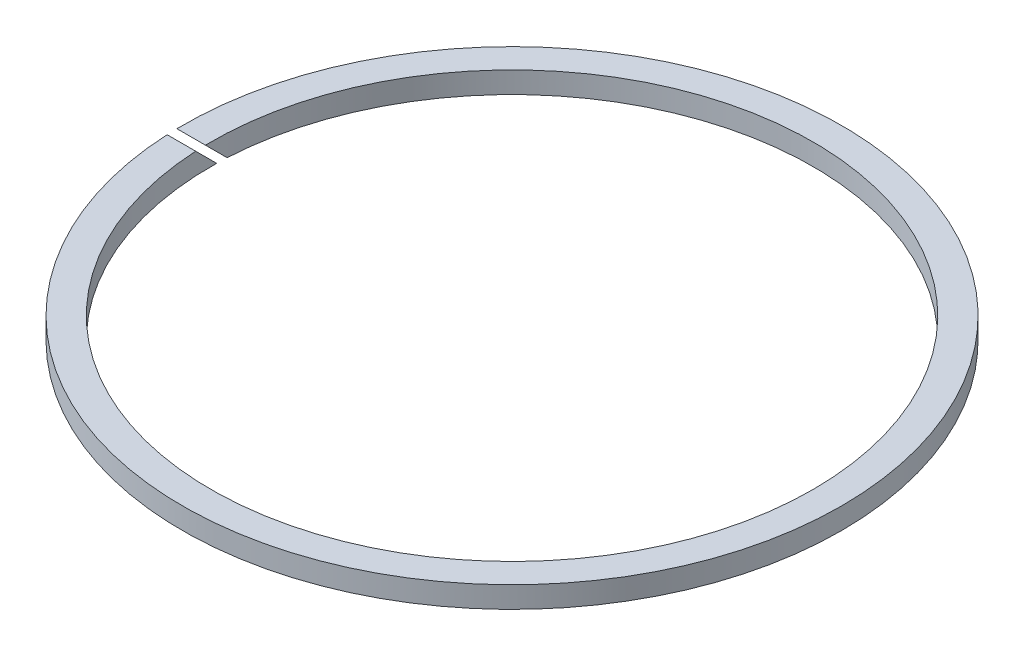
ISO-10303-21;
HEADER;
FILE_DESCRIPTION(('STEP AP214'),'2;1');
FILE_NAME('part.step','',(''),(''),'','','');
FILE_SCHEMA(('AUTOMOTIVE_DESIGN { 1 0 10303 214 1 1 1 1 }'));
ENDSEC;
DATA;
#1=APPLICATION_CONTEXT('core data for automotive mechanical design processes');
#2=APPLICATION_PROTOCOL_DEFINITION('international standard','automotive_design',2000,#1);
#3=PRODUCT_CONTEXT('',#1,'mechanical');
#4=PRODUCT('Part','Part','',(#3));
#5=PRODUCT_RELATED_PRODUCT_CATEGORY('part','',(#4));
#6=PRODUCT_DEFINITION_FORMATION('','',#4);
#7=PRODUCT_DEFINITION_CONTEXT('part definition',#1,'design');
#8=PRODUCT_DEFINITION('design','',#6,#7);
#9=PRODUCT_DEFINITION_SHAPE('','',#8);
#10=(LENGTH_UNIT() NAMED_UNIT(*) SI_UNIT(.MILLI.,.METRE.));
#11=(NAMED_UNIT(*) PLANE_ANGLE_UNIT() SI_UNIT($,.RADIAN.));
#12=(NAMED_UNIT(*) SI_UNIT($,.STERADIAN.) SOLID_ANGLE_UNIT());
#13=UNCERTAINTY_MEASURE_WITH_UNIT(LENGTH_MEASURE(1.E-05),#10,'distance_accuracy_value','');
#14=(GEOMETRIC_REPRESENTATION_CONTEXT(3) GLOBAL_UNCERTAINTY_ASSIGNED_CONTEXT((#13)) GLOBAL_UNIT_ASSIGNED_CONTEXT((#10,
#11,#12)) REPRESENTATION_CONTEXT('',''));
#15=CARTESIAN_POINT('',(0.,0.,0.));
#16=DIRECTION('',(0.,0.,1.));
#17=DIRECTION('',(1.,0.,0.));
#18=AXIS2_PLACEMENT_3D('',#15,#16,#17);
#19=CARTESIAN_POINT('',(0.,1.5,0.));
#20=DIRECTION('',(0.,1.,0.));
#21=DIRECTION('',(0.,0.,1.));
#22=AXIS2_PLACEMENT_3D('',#19,#20,#21);
#23=PLANE('',#22);
#24=DIRECTION('',(-1.,0.,0.));
#25=VECTOR('',#24,1.);
#26=CARTESIAN_POINT('',(-46.251,1.5,2.20710678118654));
#27=LINE('',#26,#25);
#28=CARTESIAN_POINT('',(-42.1923118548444,1.5,2.20710678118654));
#29=VERTEX_POINT('',#28);
#30=CARTESIAN_POINT('',(-46.197307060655,1.5,2.20710678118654));
#31=VERTEX_POINT('',#30);
#32=EDGE_CURVE('E55',#29,#31,#27,.T.);
#33=ORIENTED_EDGE('',*,*,#32,.T.);
#34=CARTESIAN_POINT('',(0.,1.5,0.));
#35=DIRECTION('',(0.,1.,0.));
#36=DIRECTION('',(0.,0.,1.));
#37=AXIS2_PLACEMENT_3D('',#34,#35,#36);
#38=CIRCLE('',#37,46.25);
#39=CARTESIAN_POINT('',(-46.2432029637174,1.5,0.792893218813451));
#40=VERTEX_POINT('',#39);
#41=EDGE_CURVE('E11',#31,#40,#38,.T.);
#42=ORIENTED_EDGE('',*,*,#41,.T.);
#43=DIRECTION('',(1.,0.,0.));
#44=VECTOR('',#43,1.);
#45=CARTESIAN_POINT('',(-46.251,1.5,0.792893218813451));
#46=LINE('',#45,#44);
#47=CARTESIAN_POINT('',(-42.242559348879,1.5,0.792893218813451));
#48=VERTEX_POINT('',#47);
#49=EDGE_CURVE('E73',#40,#48,#46,.T.);
#50=ORIENTED_EDGE('',*,*,#49,.T.);
#51=CARTESIAN_POINT('',(0.,1.5,0.));
#52=DIRECTION('',(0.,1.,0.));
#53=DIRECTION('',(0.,0.,1.));
#54=AXIS2_PLACEMENT_3D('',#51,#52,#53);
#55=CIRCLE('',#54,42.25);
#56=EDGE_CURVE('E83',#29,#48,#55,.T.);
#57=ORIENTED_EDGE('',*,*,#56,.F.);
#58=EDGE_LOOP('',(#33,#42,#50,#57));
#59=FACE_BOUND('',#58,.T.);
#60=ADVANCED_FACE('F32',(#59),#23,.T.);
#61=CARTESIAN_POINT('',(0.,-1.5,0.));
#62=DIRECTION('',(0.,1.,0.));
#63=DIRECTION('',(0.,0.,1.));
#64=AXIS2_PLACEMENT_3D('',#61,#62,#63);
#65=PLANE('',#64);
#66=CARTESIAN_POINT('',(0.,-1.5,0.));
#67=DIRECTION('',(0.,1.,0.));
#68=DIRECTION('',(0.,0.,1.));
#69=AXIS2_PLACEMENT_3D('',#66,#67,#68);
#70=CIRCLE('',#69,46.25);
#71=CARTESIAN_POINT('',(-46.2432029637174,-1.5,-0.792893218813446));
#72=VERTEX_POINT('',#71);
#73=CARTESIAN_POINT('',(-46.197307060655,-1.5,-2.20710678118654));
#74=VERTEX_POINT('',#73);
#75=EDGE_CURVE('E36',#72,#74,#70,.T.);
#76=ORIENTED_EDGE('',*,*,#75,.F.);
#77=DIRECTION('',(-1.,0.,0.));
#78=VECTOR('',#77,1.);
#79=CARTESIAN_POINT('',(-46.251,-1.5,-0.792893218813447));
#80=LINE('',#79,#78);
#81=CARTESIAN_POINT('',(-42.242559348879,-1.5,-0.792893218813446));
#82=VERTEX_POINT('',#81);
#83=EDGE_CURVE('E96',#82,#72,#80,.T.);
#84=ORIENTED_EDGE('',*,*,#83,.F.);
#85=CARTESIAN_POINT('',(0.,-1.5,0.));
#86=DIRECTION('',(0.,1.,0.));
#87=DIRECTION('',(0.,0.,1.));
#88=AXIS2_PLACEMENT_3D('',#85,#86,#87);
#89=CIRCLE('',#88,42.25);
#90=CARTESIAN_POINT('',(-42.1923118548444,-1.5,-2.20710678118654));
#91=VERTEX_POINT('',#90);
#92=EDGE_CURVE('E88',#82,#91,#89,.T.);
#93=ORIENTED_EDGE('',*,*,#92,.T.);
#94=DIRECTION('',(1.,0.,0.));
#95=VECTOR('',#94,1.);
#96=CARTESIAN_POINT('',(-46.251,-1.5,-2.20710678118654));
#97=LINE('',#96,#95);
#98=EDGE_CURVE('E47',#74,#91,#97,.T.);
#99=ORIENTED_EDGE('',*,*,#98,.F.);
#100=EDGE_LOOP('',(#76,#84,#93,#99));
#101=FACE_BOUND('',#100,.T.);
#102=ADVANCED_FACE('F103',(#101),#65,.F.);
#103=CARTESIAN_POINT('',(0.,1.5,0.));
#104=DIRECTION('',(0.,-1.,0.));
#105=DIRECTION('',(0.,0.,-1.));
#106=AXIS2_PLACEMENT_3D('',#103,#104,#105);
#107=CYLINDRICAL_SURFACE('',#106,46.25);
#108=ORIENTED_EDGE('',*,*,#41,.F.);
#109=CARTESIAN_POINT('',(0.,-0.707106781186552,0.));
#110=DIRECTION('',(0.,-0.707106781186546,0.707106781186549));
#111=DIRECTION('',(0.,-0.707106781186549,-0.707106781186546));
#112=AXIS2_PLACEMENT_3D('',#109,#110,#111);
#113=ELLIPSE('',#112,65.4073772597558,46.25);
#114=EDGE_CURVE('E91',#72,#31,#113,.F.);
#115=ORIENTED_EDGE('',*,*,#114,.F.);
#116=ORIENTED_EDGE('',*,*,#75,.T.);
#117=CARTESIAN_POINT('',(0.,0.707106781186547,0.));
#118=DIRECTION('',(0.,0.707106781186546,-0.707106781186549));
#119=DIRECTION('',(0.,-0.707106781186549,-0.707106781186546));
#120=AXIS2_PLACEMENT_3D('',#117,#118,#119);
#121=ELLIPSE('',#120,65.4073772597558,46.25);
#122=EDGE_CURVE('E79',#40,#74,#121,.F.);
#123=ORIENTED_EDGE('',*,*,#122,.F.);
#124=EDGE_LOOP('',(#108,#115,#116,#123));
#125=FACE_BOUND('',#124,.T.);
#126=ADVANCED_FACE('F34',(#125),#107,.T.);
#127=CARTESIAN_POINT('',(0.,1.5,0.));
#128=DIRECTION('',(0.,-1.,0.));
#129=DIRECTION('',(0.,0.,-1.));
#130=AXIS2_PLACEMENT_3D('',#127,#128,#129);
#131=CYLINDRICAL_SURFACE('',#130,42.25);
#132=CARTESIAN_POINT('',(0.,-0.707106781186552,0.));
#133=DIRECTION('',(0.,-0.707106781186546,0.707106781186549));
#134=DIRECTION('',(0.,-0.707106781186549,-0.707106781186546));
#135=AXIS2_PLACEMENT_3D('',#132,#133,#134);
#136=ELLIPSE('',#135,59.7505230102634,42.25);
#137=EDGE_CURVE('E85',#82,#29,#136,.F.);
#138=ORIENTED_EDGE('',*,*,#137,.T.);
#139=ORIENTED_EDGE('',*,*,#56,.T.);
#140=CARTESIAN_POINT('',(0.,0.707106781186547,0.));
#141=DIRECTION('',(0.,0.707106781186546,-0.707106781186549));
#142=DIRECTION('',(0.,-0.707106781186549,-0.707106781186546));
#143=AXIS2_PLACEMENT_3D('',#140,#141,#142);
#144=ELLIPSE('',#143,59.7505230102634,42.25);
#145=EDGE_CURVE('E70',#48,#91,#144,.F.);
#146=ORIENTED_EDGE('',*,*,#145,.T.);
#147=ORIENTED_EDGE('',*,*,#92,.F.);
#148=EDGE_LOOP('',(#138,#139,#146,#147));
#149=FACE_BOUND('',#148,.T.);
#150=ADVANCED_FACE('F87',(#149),#131,.F.);
#151=CARTESIAN_POINT('',(-46.251,4.38001871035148,3.67291192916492));
#152=DIRECTION('',(0.,0.707106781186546,-0.707106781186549));
#153=DIRECTION('',(0.,0.707106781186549,0.707106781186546));
#154=AXIS2_PLACEMENT_3D('',#151,#152,#153);
#155=PLANE('',#154);
#156=ORIENTED_EDGE('',*,*,#122,.T.);
#157=ORIENTED_EDGE('',*,*,#98,.T.);
#158=ORIENTED_EDGE('',*,*,#145,.F.);
#159=ORIENTED_EDGE('',*,*,#49,.F.);
#160=EDGE_LOOP('',(#156,#157,#158,#159));
#161=FACE_BOUND('',#160,.T.);
#162=ADVANCED_FACE('F72',(#161),#155,.F.);
#163=CARTESIAN_POINT('',(-46.251,3.67291192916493,4.38001871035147));
#164=DIRECTION('',(0.,-0.707106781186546,0.707106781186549));
#165=DIRECTION('',(0.,-0.707106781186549,-0.707106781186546));
#166=AXIS2_PLACEMENT_3D('',#163,#164,#165);
#167=PLANE('',#166);
#168=ORIENTED_EDGE('',*,*,#114,.T.);
#169=ORIENTED_EDGE('',*,*,#32,.F.);
#170=ORIENTED_EDGE('',*,*,#137,.F.);
#171=ORIENTED_EDGE('',*,*,#83,.T.);
#172=EDGE_LOOP('',(#168,#169,#170,#171));
#173=FACE_BOUND('',#172,.T.);
#174=ADVANCED_FACE('F106',(#173),#167,.F.);
#175=CLOSED_SHELL('',(#60,#102,#126,#150,#162,#174));
#176=MANIFOLD_SOLID_BREP('B2',#175);
#177=ADVANCED_BREP_SHAPE_REPRESENTATION('',(#18,#176),#14);
#178=SHAPE_DEFINITION_REPRESENTATION(#9,#177);
ENDSEC;
END-ISO-10303-21;
